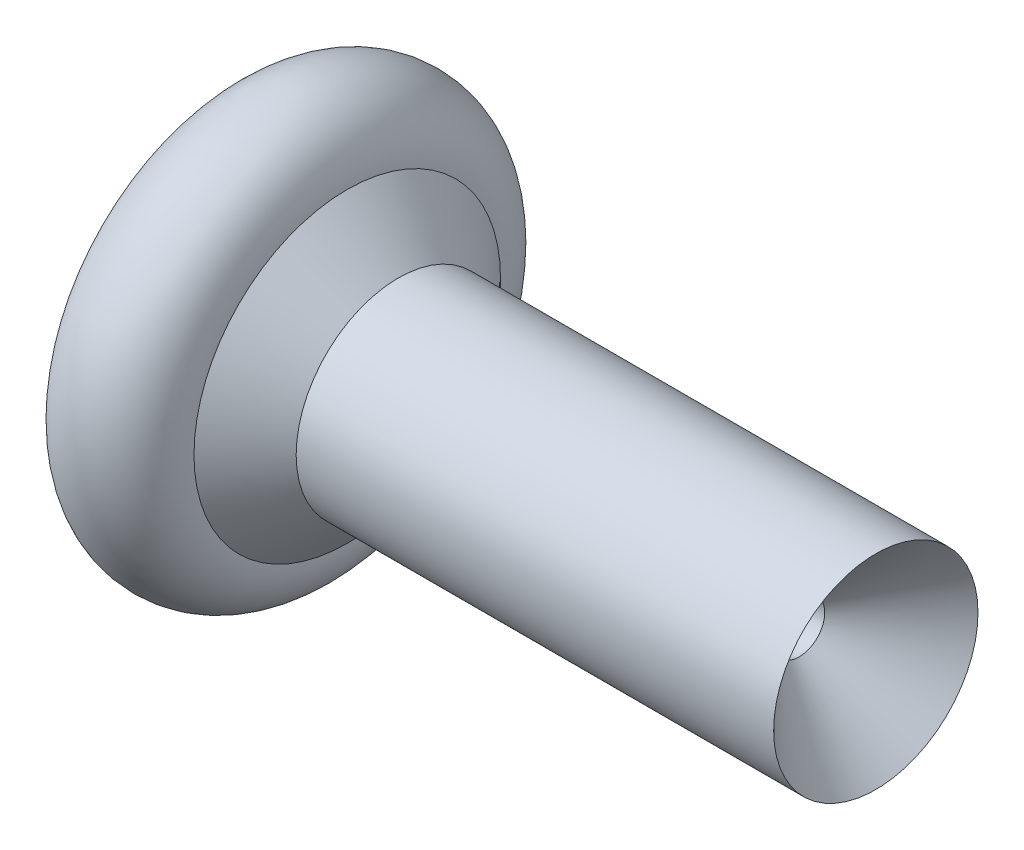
from build123d import *


with BuildPart() as part:
    # Sketch1 → Revolve1 (revolve)
    with BuildSketch(Plane(origin=(0, 0, 0), x_dir=(1, 0, 0), z_dir=(0, 1, 0)), mode=Mode.PRIVATE) as revolve1_sk:
        with BuildLine():
            Line((0, 15), (0, 30))
            ThreePointArc((0, 30), (12, 42), (24, 30))
            Line((24, 30), (34, 20))
            Line((34, 20), (127.474774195, 20))
            Line((127.474774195, 20), (112.474774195, 5))
            Line((112.474774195, 5), (82.474774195, 5))
            Line((82.474774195, 5), (82.474774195, 0))
            Line((82.474774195, 0), (62.474774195, 0))
            Line((62.474774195, 0), (35, 10))
            Line((35, 10), (35, 5))
            Line((35, 5), (20, 5))
            Line((20, 5), (20, 15))
            Line((20, 15), (0, 15))
        make_face()
    revolve(revolve1_sk.sketch.rotate(Axis((0, 0, 0), (1, 0, 0)), 180), axis=Axis((0, 0, 0), (1, 0, 0)))


solid = part.part
